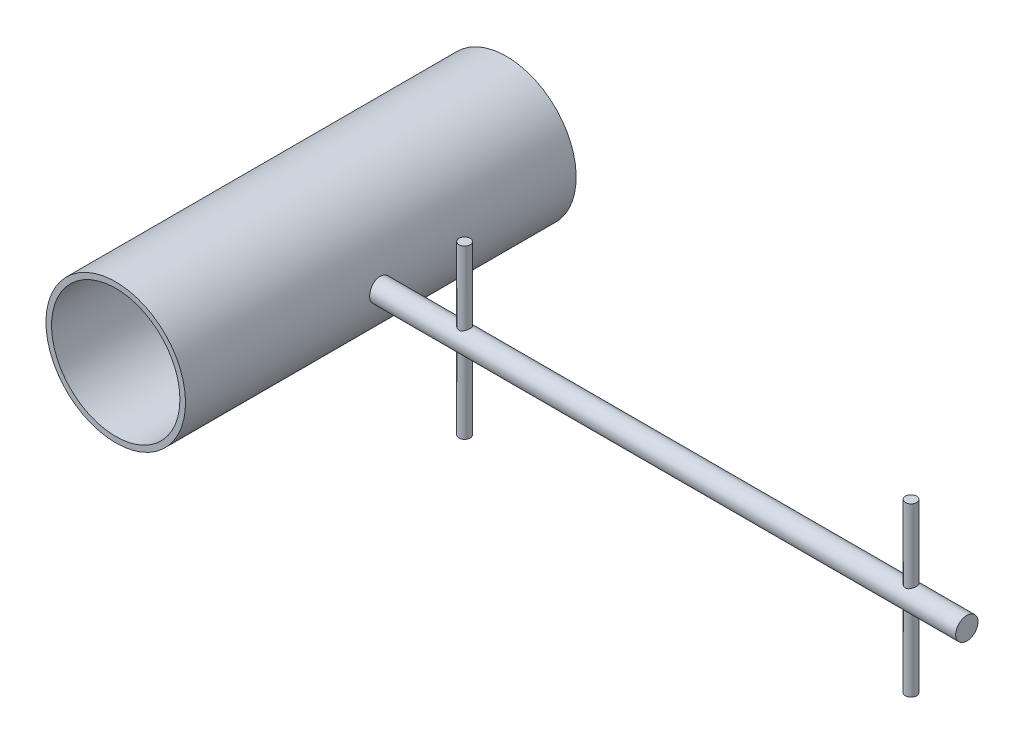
ISO-10303-21;
HEADER;
FILE_DESCRIPTION(('STEP AP214'),'2;1');
FILE_NAME('part.step','',(''),(''),'','','');
FILE_SCHEMA(('AUTOMOTIVE_DESIGN { 1 0 10303 214 1 1 1 1 }'));
ENDSEC;
DATA;
#1=APPLICATION_CONTEXT('core data for automotive mechanical design processes');
#2=APPLICATION_PROTOCOL_DEFINITION('international standard','automotive_design',2000,#1);
#3=PRODUCT_CONTEXT('',#1,'mechanical');
#4=PRODUCT('Part','Part','',(#3));
#5=PRODUCT_RELATED_PRODUCT_CATEGORY('part','',(#4));
#6=PRODUCT_DEFINITION_FORMATION('','',#4);
#7=PRODUCT_DEFINITION_CONTEXT('part definition',#1,'design');
#8=PRODUCT_DEFINITION('design','',#6,#7);
#9=PRODUCT_DEFINITION_SHAPE('','',#8);
#10=(LENGTH_UNIT() NAMED_UNIT(*) SI_UNIT(.MILLI.,.METRE.));
#11=(NAMED_UNIT(*) PLANE_ANGLE_UNIT() SI_UNIT($,.RADIAN.));
#12=(NAMED_UNIT(*) SI_UNIT($,.STERADIAN.) SOLID_ANGLE_UNIT());
#13=UNCERTAINTY_MEASURE_WITH_UNIT(LENGTH_MEASURE(1.E-05),#10,'distance_accuracy_value','');
#14=(GEOMETRIC_REPRESENTATION_CONTEXT(3) GLOBAL_UNCERTAINTY_ASSIGNED_CONTEXT((#13)) GLOBAL_UNIT_ASSIGNED_CONTEXT((#10,
#11,#12)) REPRESENTATION_CONTEXT('',''));
#15=CARTESIAN_POINT('',(0.,0.,0.));
#16=DIRECTION('',(0.,0.,1.));
#17=DIRECTION('',(1.,0.,0.));
#18=AXIS2_PLACEMENT_3D('',#15,#16,#17);
#19=CARTESIAN_POINT('',(0.,0.,-35.));
#20=DIRECTION('',(0.,0.,1.));
#21=DIRECTION('',(1.,0.,0.));
#22=AXIS2_PLACEMENT_3D('',#19,#20,#21);
#23=CYLINDRICAL_SURFACE('',#22,11.5);
#24=CARTESIAN_POINT('',(0.,0.,35.));
#25=DIRECTION('',(0.,0.,1.));
#26=DIRECTION('',(1.,0.,0.));
#27=AXIS2_PLACEMENT_3D('',#24,#25,#26);
#28=CIRCLE('',#27,11.5);
#29=CARTESIAN_POINT('',(11.5,0.,35.));
#30=VERTEX_POINT('',#29);
#31=EDGE_CURVE('E178',#30,#30,#28,.F.);
#32=ORIENTED_EDGE('',*,*,#31,.F.);
#33=EDGE_LOOP('',(#32));
#34=FACE_BOUND('',#33,.T.);
#35=CARTESIAN_POINT('',(0.,0.,-35.));
#36=DIRECTION('',(0.,0.,1.));
#37=DIRECTION('',(1.,0.,0.));
#38=AXIS2_PLACEMENT_3D('',#35,#36,#37);
#39=CIRCLE('',#38,11.5);
#40=CARTESIAN_POINT('',(11.5,0.,-35.));
#41=VERTEX_POINT('',#40);
#42=EDGE_CURVE('E19',#41,#41,#39,.T.);
#43=ORIENTED_EDGE('',*,*,#42,.F.);
#44=EDGE_LOOP('',(#43));
#45=FACE_BOUND('',#44,.T.);
#46=ADVANCED_FACE('F14',(#34,#45),#23,.F.);
#47=CARTESIAN_POINT('',(106.4,-15.,1.1));
#48=DIRECTION('',(0.,-1.,0.));
#49=DIRECTION('',(0.,0.,-1.));
#50=AXIS2_PLACEMENT_3D('',#47,#48,#49);
#51=PLANE('',#50);
#52=CARTESIAN_POINT('',(107.5,-15.,0.));
#53=DIRECTION('',(0.,-1.,0.));
#54=DIRECTION('',(0.,0.,-1.));
#55=AXIS2_PLACEMENT_3D('',#52,#53,#54);
#56=CIRCLE('',#55,0.999999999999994);
#57=CARTESIAN_POINT('',(107.5,-15.,-0.99999999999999));
#58=VERTEX_POINT('',#57);
#59=EDGE_CURVE('E181',#58,#58,#56,.F.);
#60=ORIENTED_EDGE('',*,*,#59,.F.);
#61=EDGE_LOOP('',(#60));
#62=FACE_BOUND('',#61,.T.);
#63=ADVANCED_FACE('F157',(#62),#51,.T.);
#64=CARTESIAN_POINT('',(26.4,-15.,1.1));
#65=DIRECTION('',(0.,-1.,0.));
#66=DIRECTION('',(0.,0.,-1.));
#67=AXIS2_PLACEMENT_3D('',#64,#65,#66);
#68=PLANE('',#67);
#69=CARTESIAN_POINT('',(27.5,-15.,0.));
#70=DIRECTION('',(0.,-1.,0.));
#71=DIRECTION('',(0.,0.,-1.));
#72=AXIS2_PLACEMENT_3D('',#69,#70,#71);
#73=CIRCLE('',#72,0.999999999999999);
#74=CARTESIAN_POINT('',(27.5,-15.,-0.999999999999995));
#75=VERTEX_POINT('',#74);
#76=EDGE_CURVE('E183',#75,#75,#73,.F.);
#77=ORIENTED_EDGE('',*,*,#76,.F.);
#78=EDGE_LOOP('',(#77));
#79=FACE_BOUND('',#78,.T.);
#80=ADVANCED_FACE('F149',(#79),#68,.T.);
#81=CARTESIAN_POINT('',(26.4,15.,-1.1));
#82=DIRECTION('',(0.,1.,0.));
#83=DIRECTION('',(0.,0.,1.));
#84=AXIS2_PLACEMENT_3D('',#81,#82,#83);
#85=PLANE('',#84);
#86=CARTESIAN_POINT('',(27.5,15.,0.));
#87=DIRECTION('',(0.,-1.,0.));
#88=DIRECTION('',(0.,0.,-1.));
#89=AXIS2_PLACEMENT_3D('',#86,#87,#88);
#90=CIRCLE('',#89,1.);
#91=CARTESIAN_POINT('',(27.5,15.,-0.999999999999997));
#92=VERTEX_POINT('',#91);
#93=EDGE_CURVE('E188',#92,#92,#90,.T.);
#94=ORIENTED_EDGE('',*,*,#93,.F.);
#95=EDGE_LOOP('',(#94));
#96=FACE_BOUND('',#95,.T.);
#97=ADVANCED_FACE('F141',(#96),#85,.T.);
#98=CARTESIAN_POINT('',(13.75,-13.75,-35.));
#99=DIRECTION('',(0.,0.,-1.));
#100=DIRECTION('',(-1.,0.,0.));
#101=AXIS2_PLACEMENT_3D('',#98,#99,#100);
#102=PLANE('',#101);
#103=ORIENTED_EDGE('',*,*,#42,.T.);
#104=EDGE_LOOP('',(#103));
#105=FACE_BOUND('',#104,.T.);
#106=CARTESIAN_POINT('',(0.,0.,-35.));
#107=DIRECTION('',(0.,0.,1.));
#108=DIRECTION('',(0.,-1.,0.));
#109=AXIS2_PLACEMENT_3D('',#106,#107,#108);
#110=CIRCLE('',#109,12.5);
#111=CARTESIAN_POINT('',(0.,-12.5,-35.));
#112=VERTEX_POINT('',#111);
#113=EDGE_CURVE('E191',#112,#112,#110,.T.);
#114=ORIENTED_EDGE('',*,*,#113,.F.);
#115=EDGE_LOOP('',(#114));
#116=FACE_BOUND('',#115,.T.);
#117=ADVANCED_FACE('F133',(#105,#116),#102,.T.);
#118=CARTESIAN_POINT('',(-13.75,-13.75,35.));
#119=DIRECTION('',(0.,0.,1.));
#120=DIRECTION('',(1.,0.,0.));
#121=AXIS2_PLACEMENT_3D('',#118,#119,#120);
#122=PLANE('',#121);
#123=ORIENTED_EDGE('',*,*,#31,.T.);
#124=EDGE_LOOP('',(#123));
#125=FACE_BOUND('',#124,.T.);
#126=CARTESIAN_POINT('',(0.,0.,35.));
#127=DIRECTION('',(0.,0.,1.));
#128=DIRECTION('',(0.,-1.,0.));
#129=AXIS2_PLACEMENT_3D('',#126,#127,#128);
#130=CIRCLE('',#129,12.5);
#131=CARTESIAN_POINT('',(0.,-12.5,35.));
#132=VERTEX_POINT('',#131);
#133=EDGE_CURVE('E194',#132,#132,#130,.F.);
#134=ORIENTED_EDGE('',*,*,#133,.F.);
#135=EDGE_LOOP('',(#134));
#136=FACE_BOUND('',#135,.T.);
#137=ADVANCED_FACE('F125',(#125,#136),#122,.T.);
#138=CARTESIAN_POINT('',(117.5,-2.2,2.2));
#139=DIRECTION('',(1.,0.,0.));
#140=DIRECTION('',(0.,0.,-1.));
#141=AXIS2_PLACEMENT_3D('',#138,#139,#140);
#142=PLANE('',#141);
#143=CARTESIAN_POINT('',(117.5,0.,0.));
#144=DIRECTION('',(-1.,0.,0.));
#145=DIRECTION('',(0.,0.,1.));
#146=AXIS2_PLACEMENT_3D('',#143,#144,#145);
#147=CIRCLE('',#146,2.);
#148=CARTESIAN_POINT('',(117.5,0.,2.00000000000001));
#149=VERTEX_POINT('',#148);
#150=EDGE_CURVE('E195',#149,#149,#147,.T.);
#151=ORIENTED_EDGE('',*,*,#150,.F.);
#152=EDGE_LOOP('',(#151));
#153=FACE_BOUND('',#152,.T.);
#154=ADVANCED_FACE('F118',(#153),#142,.T.);
#155=CARTESIAN_POINT('',(107.5,-15.,0.));
#156=DIRECTION('',(0.,-1.,0.));
#157=DIRECTION('',(0.,0.,-1.));
#158=AXIS2_PLACEMENT_3D('',#155,#156,#157);
#159=CYLINDRICAL_SURFACE('',#158,0.999999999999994);
#160=CARTESIAN_POINT('',(107.5,-1.73205080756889,0.999999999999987));
#161=CARTESIAN_POINT('',(107.552107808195,-1.7320553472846,0.999996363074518));
#162=CARTESIAN_POINT('',(107.604281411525,-1.73443801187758,0.995899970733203));
#163=CARTESIAN_POINT('',(107.707027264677,-1.74362366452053,0.979723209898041));
#164=CARTESIAN_POINT('',(107.757595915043,-1.7504359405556,0.967626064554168));
#165=CARTESIAN_POINT('',(107.855451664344,-1.76749346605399,0.936099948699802));
#166=CARTESIAN_POINT('',(107.902754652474,-1.77772043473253,0.91670995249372));
#167=CARTESIAN_POINT('',(107.993424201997,-1.80042664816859,0.871267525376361));
#168=CARTESIAN_POINT('',(108.036790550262,-1.81290601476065,0.845214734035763));
#169=CARTESIAN_POINT('',(108.122305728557,-1.83996869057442,0.78466654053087));
#170=CARTESIAN_POINT('',(108.164059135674,-1.85464063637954,0.749652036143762));
#171=CARTESIAN_POINT('',(108.241408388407,-1.88371982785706,0.673253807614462));
#172=CARTESIAN_POINT('',(108.277001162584,-1.8981269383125,0.631866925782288));
#173=CARTESIAN_POINT('',(108.343367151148,-1.92621476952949,0.540489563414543));
#174=CARTESIAN_POINT('',(108.37365376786,-1.93978106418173,0.490107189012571));
#175=CARTESIAN_POINT('',(108.425140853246,-1.96350756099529,0.3841570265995));
#176=CARTESIAN_POINT('',(108.446347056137,-1.97366991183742,0.32859253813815));
#177=CARTESIAN_POINT('',(108.477504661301,-1.98880461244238,0.218044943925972));
#178=CARTESIAN_POINT('',(108.488149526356,-1.99409480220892,0.163301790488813));
#179=CARTESIAN_POINT('',(108.500166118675,-2.00007583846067,0.052570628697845));
#180=CARTESIAN_POINT('',(108.501543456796,-2.0007694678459,-0.00341660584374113));
#181=CARTESIAN_POINT('',(108.49525332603,-1.9976298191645,-0.109832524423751));
#182=CARTESIAN_POINT('',(108.488361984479,-1.9941849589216,-0.160321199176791));
#183=CARTESIAN_POINT('',(108.467119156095,-1.98374245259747,-0.259313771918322));
#184=CARTESIAN_POINT('',(108.452767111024,-1.97674454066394,-0.307817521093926));
#185=CARTESIAN_POINT('',(108.41691743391,-1.95971583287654,-0.402309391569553));
#186=CARTESIAN_POINT('',(108.395323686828,-1.94964441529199,-0.448253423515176));
#187=CARTESIAN_POINT('',(108.345736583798,-1.92737645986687,-0.535976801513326));
#188=CARTESIAN_POINT('',(108.317740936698,-1.91517916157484,-0.577754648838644));
#189=CARTESIAN_POINT('',(108.253104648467,-1.88844394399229,-0.660173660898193));
#190=CARTESIAN_POINT('',(108.215896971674,-1.87379375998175,-0.700334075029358));
#191=CARTESIAN_POINT('',(108.13541027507,-1.84454340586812,-0.774104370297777));
#192=CARTESIAN_POINT('',(108.092126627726,-1.82994328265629,-0.807709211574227));
#193=CARTESIAN_POINT('',(107.997351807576,-1.80144156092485,-0.869505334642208));
#194=CARTESIAN_POINT('',(107.945513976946,-1.78764319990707,-0.89721731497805));
#195=CARTESIAN_POINT('',(107.837062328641,-1.76375450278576,-0.943319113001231));
#196=CARTESIAN_POINT('',(107.780453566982,-1.75366030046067,-0.96171865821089));
#197=CARTESIAN_POINT('',(107.668785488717,-1.73944635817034,-0.987180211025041));
#198=CARTESIAN_POINT('',(107.613958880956,-1.73491655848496,-0.995025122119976));
#199=CARTESIAN_POINT('',(107.503598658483,-1.73117919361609,-1.00151694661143));
#200=CARTESIAN_POINT('',(107.44806557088,-1.73196786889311,-1.00017035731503));
#201=CARTESIAN_POINT('',(107.344346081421,-1.73834336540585,-0.989036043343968));
#202=CARTESIAN_POINT('',(107.296020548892,-1.74339587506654,-0.980187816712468));
#203=CARTESIAN_POINT('',(107.201632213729,-1.75694021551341,-0.955696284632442));
#204=CARTESIAN_POINT('',(107.155570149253,-1.76543316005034,-0.940050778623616));
#205=CARTESIAN_POINT('',(107.064588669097,-1.78536222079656,-0.901647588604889));
#206=CARTESIAN_POINT('',(107.019820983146,-1.79691643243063,-0.878594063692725));
#207=CARTESIAN_POINT('',(106.934530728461,-1.82156119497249,-0.826287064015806));
#208=CARTESIAN_POINT('',(106.894010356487,-1.83465253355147,-0.797030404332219));
#209=CARTESIAN_POINT('',(106.813021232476,-1.86287998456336,-0.728837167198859));
#210=CARTESIAN_POINT('',(106.773202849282,-1.87806583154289,-0.689145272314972));
#211=CARTESIAN_POINT('',(106.700587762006,-1.90734234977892,-0.603404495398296));
#212=CARTESIAN_POINT('',(106.667793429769,-1.92143265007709,-0.557353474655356));
#213=CARTESIAN_POINT('',(106.60942627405,-1.94741361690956,-0.458535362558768));
#214=CARTESIAN_POINT('',(106.584066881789,-1.95923641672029,-0.405623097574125));
#215=CARTESIAN_POINT('',(106.542862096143,-1.97883354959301,-0.295522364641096));
#216=CARTESIAN_POINT('',(106.527008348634,-1.98661143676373,-0.238337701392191));
#217=CARTESIAN_POINT('',(106.506631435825,-1.99667508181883,-0.126979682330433));
#218=CARTESIAN_POINT('',(106.501202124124,-1.99939927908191,-0.0730114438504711));
#219=CARTESIAN_POINT('',(106.499156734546,-2.00042130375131,0.0351259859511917));
#220=CARTESIAN_POINT('',(106.502537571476,-1.9987206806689,0.0892951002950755));
#221=CARTESIAN_POINT('',(106.517416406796,-1.99133968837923,0.192537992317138));
#222=CARTESIAN_POINT('',(106.528364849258,-1.9859289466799,0.241712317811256));
#223=CARTESIAN_POINT('',(106.557326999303,-1.97192093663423,0.337445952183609));
#224=CARTESIAN_POINT('',(106.575341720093,-1.96332321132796,0.384004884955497));
#225=CARTESIAN_POINT('',(106.618727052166,-1.94325930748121,0.475423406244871));
#226=CARTESIAN_POINT('',(106.644379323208,-1.93168617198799,0.520125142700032));
#227=CARTESIAN_POINT('',(106.701957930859,-1.90688133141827,0.604774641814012));
#228=CARTESIAN_POINT('',(106.733887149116,-1.89364886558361,0.644720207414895));
#229=CARTESIAN_POINT('',(106.806797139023,-1.86528610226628,0.722914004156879));
#230=CARTESIAN_POINT('',(106.848362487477,-1.85009799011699,0.760597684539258));
#231=CARTESIAN_POINT('',(106.93745072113,-1.82063076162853,0.82866328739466));
#232=CARTESIAN_POINT('',(106.984978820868,-1.80635245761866,0.859038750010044));
#233=CARTESIAN_POINT('',(107.086636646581,-1.77999605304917,0.912431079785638));
#234=CARTESIAN_POINT('',(107.140927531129,-1.76800174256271,0.935185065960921));
#235=CARTESIAN_POINT('',(107.25333240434,-1.74866156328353,0.970878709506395));
#236=CARTESIAN_POINT('',(107.311432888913,-1.74130016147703,0.983851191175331));
#237=CARTESIAN_POINT('',(107.391805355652,-1.73529272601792,0.9943670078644));
#238=CARTESIAN_POINT('',(107.413367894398,-1.73408129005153,0.996476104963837));
#239=CARTESIAN_POINT('',(107.456616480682,-1.73245935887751,0.999293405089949));
#240=CARTESIAN_POINT('',(107.478302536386,-1.7320489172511,1.00000151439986));
#241=CARTESIAN_POINT('',(107.5,-1.73205080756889,0.999999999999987));
#242=B_SPLINE_CURVE_WITH_KNOTS('',3,(#160,#161,#162,#163,#164,#165,#166,#167,#168,#169,#170,
#171,#172,#173,#174,#175,#176,#177,#178,#179,#180,#181,#182,#183,#184,#185,#186,#187,#188,#189,
#190,#191,#192,#193,#194,#195,#196,#197,#198,#199,#200,#201,#202,#203,#204,#205,#206,#207,#208,
#209,#210,#211,#212,#213,#214,#215,#216,#217,#218,#219,#220,#221,#222,#223,#224,#225,#226,#227,
#228,#229,#230,#231,#232,#233,#234,#235,#236,#237,#238,#239,#240,#241),.UNSPECIFIED.,.T.,.F.,(4,
2,2,2,2,2,2,2,2,2,2,2,2,2,2,2,2,2,2,2,2,2,2,2,2,2,2,2,2,2,2,2,2,2,2,2,2,2,2,2,4),(0.,
0.15623212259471,0.312792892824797,0.468528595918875,0.62427272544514,0.792862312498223,
0.961535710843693,1.14157892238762,1.3215082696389,1.48863484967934,1.65566023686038,
1.80816097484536,1.96067312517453,2.11529534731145,2.2699729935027,2.43927191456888,
2.60870048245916,2.78888841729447,2.96888774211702,3.13462290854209,3.30024093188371,
3.44774183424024,3.5952905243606,3.74967296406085,3.90413486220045,4.0780674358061,
4.25205864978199,4.43064181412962,4.60906779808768,4.77112270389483,4.93312086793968,
5.0844442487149,5.23578933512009,5.39360750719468,5.55149830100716,5.72510241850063,
5.89885942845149,6.07810749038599,6.25675133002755,6.32180135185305,6.38685572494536),.UNSPECIFIED.);
#243=CARTESIAN_POINT('',(107.5,-1.73205080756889,0.999999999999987));
#244=VERTEX_POINT('',#243);
#245=EDGE_CURVE('E43',#244,#244,#242,.T.);
#246=ORIENTED_EDGE('',*,*,#245,.F.);
#247=EDGE_LOOP('',(#246));
#248=FACE_BOUND('',#247,.T.);
#249=ORIENTED_EDGE('',*,*,#59,.T.);
#250=EDGE_LOOP('',(#249));
#251=FACE_BOUND('',#250,.T.);
#252=ADVANCED_FACE('F111',(#248,#251),#159,.T.);
#253=CARTESIAN_POINT('',(27.5,-15.,0.));
#254=DIRECTION('',(0.,-1.,0.));
#255=DIRECTION('',(0.,0.,-1.));
#256=AXIS2_PLACEMENT_3D('',#253,#254,#255);
#257=CYLINDRICAL_SURFACE('',#256,0.999999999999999);
#258=CARTESIAN_POINT('',(27.5,-1.73205080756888,0.999999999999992));
#259=CARTESIAN_POINT('',(27.5521078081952,-1.7320553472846,0.999996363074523));
#260=CARTESIAN_POINT('',(27.604281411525,-1.73443801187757,0.995899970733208));
#261=CARTESIAN_POINT('',(27.7070272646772,-1.74362366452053,0.979723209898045));
#262=CARTESIAN_POINT('',(27.7575959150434,-1.7504359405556,0.967626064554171));
#263=CARTESIAN_POINT('',(27.8554516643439,-1.76749346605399,0.936099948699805));
#264=CARTESIAN_POINT('',(27.9027546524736,-1.77772043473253,0.916709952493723));
#265=CARTESIAN_POINT('',(27.9934242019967,-1.80042664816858,0.871267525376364));
#266=CARTESIAN_POINT('',(28.0367905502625,-1.81290601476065,0.845214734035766));
#267=CARTESIAN_POINT('',(28.1223057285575,-1.83996869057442,0.784666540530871));
#268=CARTESIAN_POINT('',(28.1640591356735,-1.85464063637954,0.749652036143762));
#269=CARTESIAN_POINT('',(28.2414083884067,-1.88371982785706,0.673253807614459));
#270=CARTESIAN_POINT('',(28.2770011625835,-1.8981269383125,0.631866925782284));
#271=CARTESIAN_POINT('',(28.3433671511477,-1.92621476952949,0.540489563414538));
#272=CARTESIAN_POINT('',(28.3736537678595,-1.93978106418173,0.490107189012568));
#273=CARTESIAN_POINT('',(28.4251408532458,-1.96350756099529,0.384157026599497));
#274=CARTESIAN_POINT('',(28.4463470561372,-1.97366991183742,0.328592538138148));
#275=CARTESIAN_POINT('',(28.4775046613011,-1.98880461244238,0.21804494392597));
#276=CARTESIAN_POINT('',(28.4881495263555,-1.99409480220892,0.163301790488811));
#277=CARTESIAN_POINT('',(28.500166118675,-2.00007583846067,0.052570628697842));
#278=CARTESIAN_POINT('',(28.5015434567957,-2.0007694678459,-0.00341660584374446));
#279=CARTESIAN_POINT('',(28.4952533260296,-1.9976298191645,-0.109832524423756));
#280=CARTESIAN_POINT('',(28.4883619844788,-1.9941849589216,-0.160321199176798));
#281=CARTESIAN_POINT('',(28.4671191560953,-1.98374245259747,-0.259313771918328));
#282=CARTESIAN_POINT('',(28.4527671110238,-1.97674454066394,-0.307817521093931));
#283=CARTESIAN_POINT('',(28.4169174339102,-1.95971583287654,-0.402309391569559));
#284=CARTESIAN_POINT('',(28.3953236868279,-1.94964441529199,-0.448253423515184));
#285=CARTESIAN_POINT('',(28.3457365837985,-1.92737645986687,-0.535976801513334));
#286=CARTESIAN_POINT('',(28.3177409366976,-1.91517916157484,-0.577754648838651));
#287=CARTESIAN_POINT('',(28.253104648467,-1.88844394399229,-0.6601736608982));
#288=CARTESIAN_POINT('',(28.215896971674,-1.87379375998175,-0.700334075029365));
#289=CARTESIAN_POINT('',(28.1354102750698,-1.84454340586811,-0.774104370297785));
#290=CARTESIAN_POINT('',(28.0921266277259,-1.82994328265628,-0.807709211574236));
#291=CARTESIAN_POINT('',(27.9973518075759,-1.80144156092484,-0.869505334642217));
#292=CARTESIAN_POINT('',(27.9455139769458,-1.78764319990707,-0.897217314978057));
#293=CARTESIAN_POINT('',(27.837062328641,-1.76375450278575,-0.943319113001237));
#294=CARTESIAN_POINT('',(27.7804535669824,-1.75366030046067,-0.961718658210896));
#295=CARTESIAN_POINT('',(27.6687854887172,-1.73944635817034,-0.987180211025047));
#296=CARTESIAN_POINT('',(27.6139588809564,-1.73491655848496,-0.995025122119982));
#297=CARTESIAN_POINT('',(27.5035986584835,-1.73117919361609,-1.00151694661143));
#298=CARTESIAN_POINT('',(27.4480655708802,-1.73196786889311,-1.00017035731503));
#299=CARTESIAN_POINT('',(27.3443460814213,-1.73834336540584,-0.989036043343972));
#300=CARTESIAN_POINT('',(27.2960205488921,-1.74339587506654,-0.980187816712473));
#301=CARTESIAN_POINT('',(27.201632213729,-1.75694021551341,-0.955696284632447));
#302=CARTESIAN_POINT('',(27.1555701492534,-1.76543316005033,-0.940050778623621));
#303=CARTESIAN_POINT('',(27.0645886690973,-1.78536222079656,-0.901647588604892));
#304=CARTESIAN_POINT('',(27.0198209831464,-1.79691643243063,-0.878594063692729));
#305=CARTESIAN_POINT('',(26.934530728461,-1.82156119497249,-0.82628706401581));
#306=CARTESIAN_POINT('',(26.8940103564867,-1.83465253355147,-0.797030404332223));
#307=CARTESIAN_POINT('',(26.8130212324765,-1.86287998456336,-0.72883716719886));
#308=CARTESIAN_POINT('',(26.7732028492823,-1.87806583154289,-0.689145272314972));
#309=CARTESIAN_POINT('',(26.7005877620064,-1.90734234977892,-0.603404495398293));
#310=CARTESIAN_POINT('',(26.6677934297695,-1.92143265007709,-0.557353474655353));
#311=CARTESIAN_POINT('',(26.6094262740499,-1.94741361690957,-0.458535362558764));
#312=CARTESIAN_POINT('',(26.5840668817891,-1.95923641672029,-0.405623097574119));
#313=CARTESIAN_POINT('',(26.5428620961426,-1.97883354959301,-0.295522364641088));
#314=CARTESIAN_POINT('',(26.5270083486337,-1.98661143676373,-0.238337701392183));
#315=CARTESIAN_POINT('',(26.5066314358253,-1.99667508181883,-0.126979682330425));
#316=CARTESIAN_POINT('',(26.5012021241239,-1.99939927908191,-0.0730114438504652));
#317=CARTESIAN_POINT('',(26.4991567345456,-2.00042130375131,0.0351259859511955));
#318=CARTESIAN_POINT('',(26.5025375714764,-1.9987206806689,0.0892951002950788));
#319=CARTESIAN_POINT('',(26.5174164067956,-1.99133968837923,0.192537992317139));
#320=CARTESIAN_POINT('',(26.5283648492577,-1.9859289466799,0.241712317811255));
#321=CARTESIAN_POINT('',(26.557326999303,-1.97192093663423,0.337445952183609));
#322=CARTESIAN_POINT('',(26.5753417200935,-1.96332321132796,0.3840048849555));
#323=CARTESIAN_POINT('',(26.618727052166,-1.9432593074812,0.475423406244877));
#324=CARTESIAN_POINT('',(26.6443793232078,-1.93168617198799,0.520125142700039));
#325=CARTESIAN_POINT('',(26.701957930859,-1.90688133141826,0.604774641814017));
#326=CARTESIAN_POINT('',(26.7338871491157,-1.89364886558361,0.644720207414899));
#327=CARTESIAN_POINT('',(26.8067971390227,-1.86528610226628,0.722914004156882));
#328=CARTESIAN_POINT('',(26.8483624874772,-1.85009799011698,0.760597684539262));
#329=CARTESIAN_POINT('',(26.9374507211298,-1.82063076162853,0.828663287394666));
#330=CARTESIAN_POINT('',(26.9849788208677,-1.80635245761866,0.859038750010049));
#331=CARTESIAN_POINT('',(27.086636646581,-1.77999605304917,0.912431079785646));
#332=CARTESIAN_POINT('',(27.1409275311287,-1.76800174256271,0.935185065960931));
#333=CARTESIAN_POINT('',(27.2533324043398,-1.74866156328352,0.970878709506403));
#334=CARTESIAN_POINT('',(27.3114328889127,-1.74130016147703,0.983851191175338));
#335=CARTESIAN_POINT('',(27.391805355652,-1.73529272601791,0.994367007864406));
#336=CARTESIAN_POINT('',(27.4133678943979,-1.73408129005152,0.996476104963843));
#337=CARTESIAN_POINT('',(27.4566164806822,-1.73245935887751,0.999293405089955));
#338=CARTESIAN_POINT('',(27.4783025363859,-1.7320489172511,1.00000151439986));
#339=CARTESIAN_POINT('',(27.5,-1.73205080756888,0.999999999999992));
#340=B_SPLINE_CURVE_WITH_KNOTS('',3,(#258,#259,#260,#261,#262,#263,#264,#265,#266,#267,#268,
#269,#270,#271,#272,#273,#274,#275,#276,#277,#278,#279,#280,#281,#282,#283,#284,#285,#286,#287,
#288,#289,#290,#291,#292,#293,#294,#295,#296,#297,#298,#299,#300,#301,#302,#303,#304,#305,#306,
#307,#308,#309,#310,#311,#312,#313,#314,#315,#316,#317,#318,#319,#320,#321,#322,#323,#324,#325,
#326,#327,#328,#329,#330,#331,#332,#333,#334,#335,#336,#337,#338,#339),.UNSPECIFIED.,.T.,.F.,(4,
2,2,2,2,2,2,2,2,2,2,2,2,2,2,2,2,2,2,2,2,2,2,2,2,2,2,2,2,2,2,2,2,2,2,2,2,2,2,2,4),(0.,
0.156232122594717,0.312792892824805,0.468528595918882,0.624272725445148,0.792862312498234,
0.961535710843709,1.14157892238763,1.32150826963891,1.48863484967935,1.6556602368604,
1.80816097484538,1.96067312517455,2.11529534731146,2.26997299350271,2.4392719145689,
2.60870048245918,2.78888841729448,2.96888774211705,3.13462290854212,3.30024093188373,
3.44774183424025,3.59529052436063,3.74967296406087,3.90413486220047,4.07806743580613,
4.25205864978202,4.43064181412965,4.60906779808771,4.77112270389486,4.93312086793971,
5.08444424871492,5.23578933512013,5.39360750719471,5.55149830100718,5.72510241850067,
5.89885942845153,6.07810749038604,6.25675133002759,6.32180135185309,6.3868557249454),.UNSPECIFIED.);
#341=CARTESIAN_POINT('',(27.5,-1.73205080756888,0.999999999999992));
#342=VERTEX_POINT('',#341);
#343=EDGE_CURVE('E59',#342,#342,#340,.T.);
#344=ORIENTED_EDGE('',*,*,#343,.F.);
#345=EDGE_LOOP('',(#344));
#346=FACE_BOUND('',#345,.T.);
#347=ORIENTED_EDGE('',*,*,#76,.T.);
#348=EDGE_LOOP('',(#347));
#349=FACE_BOUND('',#348,.T.);
#350=ADVANCED_FACE('F67',(#346,#349),#257,.T.);
#351=CARTESIAN_POINT('',(27.5,1.65244039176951,0.));
#352=DIRECTION('',(0.,-1.,0.));
#353=DIRECTION('',(0.,0.,-1.));
#354=AXIS2_PLACEMENT_3D('',#351,#352,#353);
#355=CYLINDRICAL_SURFACE('',#354,1.);
#356=CARTESIAN_POINT('',(27.5,1.73205080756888,1.00000000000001));
#357=CARTESIAN_POINT('',(27.4478921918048,1.73205534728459,0.999996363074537));
#358=CARTESIAN_POINT('',(27.395718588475,1.73443801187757,0.995899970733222));
#359=CARTESIAN_POINT('',(27.2929727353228,1.74362366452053,0.979723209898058));
#360=CARTESIAN_POINT('',(27.2424040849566,1.7504359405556,0.967626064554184));
#361=CARTESIAN_POINT('',(27.1445483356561,1.76749346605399,0.936099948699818));
#362=CARTESIAN_POINT('',(27.0972453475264,1.77772043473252,0.916709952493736));
#363=CARTESIAN_POINT('',(27.0065757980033,1.80042664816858,0.871267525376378));
#364=CARTESIAN_POINT('',(26.9632094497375,1.81290601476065,0.845214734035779));
#365=CARTESIAN_POINT('',(26.8776942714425,1.83996869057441,0.784666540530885));
#366=CARTESIAN_POINT('',(26.8359408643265,1.85464063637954,0.749652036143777));
#367=CARTESIAN_POINT('',(26.7585916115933,1.88371982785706,0.673253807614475));
#368=CARTESIAN_POINT('',(26.7229988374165,1.8981269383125,0.6318669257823));
#369=CARTESIAN_POINT('',(26.6566328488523,1.92621476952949,0.540489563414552));
#370=CARTESIAN_POINT('',(26.6263462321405,1.93978106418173,0.490107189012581));
#371=CARTESIAN_POINT('',(26.5748591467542,1.96350756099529,0.384157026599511));
#372=CARTESIAN_POINT('',(26.5536529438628,1.97366991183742,0.328592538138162));
#373=CARTESIAN_POINT('',(26.5224953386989,1.98880461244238,0.218044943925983));
#374=CARTESIAN_POINT('',(26.5118504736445,1.99409480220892,0.163301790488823));
#375=CARTESIAN_POINT('',(26.499833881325,2.00007583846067,0.052570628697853));
#376=CARTESIAN_POINT('',(26.4984565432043,2.0007694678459,-0.00341660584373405));
#377=CARTESIAN_POINT('',(26.5047466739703,1.9976298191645,-0.109832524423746));
#378=CARTESIAN_POINT('',(26.5116380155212,1.99418495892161,-0.160321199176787));
#379=CARTESIAN_POINT('',(26.5328808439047,1.98374245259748,-0.259313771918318));
#380=CARTESIAN_POINT('',(26.5472328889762,1.97674454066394,-0.307817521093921));
#381=CARTESIAN_POINT('',(26.5830825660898,1.95971583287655,-0.402309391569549));
#382=CARTESIAN_POINT('',(26.6046763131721,1.94964441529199,-0.448253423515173));
#383=CARTESIAN_POINT('',(26.6542634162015,1.92737645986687,-0.535976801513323));
#384=CARTESIAN_POINT('',(26.6822590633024,1.91517916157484,-0.577754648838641));
#385=CARTESIAN_POINT('',(26.746895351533,1.88844394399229,-0.66017366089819));
#386=CARTESIAN_POINT('',(26.784103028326,1.87379375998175,-0.700334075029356));
#387=CARTESIAN_POINT('',(26.8645897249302,1.84454340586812,-0.774104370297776));
#388=CARTESIAN_POINT('',(26.9078733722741,1.82994328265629,-0.807709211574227));
#389=CARTESIAN_POINT('',(27.0026481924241,1.80144156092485,-0.869505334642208));
#390=CARTESIAN_POINT('',(27.0544860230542,1.78764319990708,-0.897217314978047));
#391=CARTESIAN_POINT('',(27.162937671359,1.76375450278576,-0.943319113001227));
#392=CARTESIAN_POINT('',(27.2195464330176,1.75366030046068,-0.961718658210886));
#393=CARTESIAN_POINT('',(27.3312145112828,1.73944635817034,-0.987180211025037));
#394=CARTESIAN_POINT('',(27.3860411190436,1.73491655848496,-0.995025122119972));
#395=CARTESIAN_POINT('',(27.4964013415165,1.7311791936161,-1.00151694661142));
#396=CARTESIAN_POINT('',(27.5519344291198,1.73196786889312,-1.00017035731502));
#397=CARTESIAN_POINT('',(27.6556539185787,1.73834336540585,-0.989036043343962));
#398=CARTESIAN_POINT('',(27.7039794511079,1.74339587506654,-0.980187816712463));
#399=CARTESIAN_POINT('',(27.798367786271,1.75694021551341,-0.955696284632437));
#400=CARTESIAN_POINT('',(27.8444298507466,1.76543316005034,-0.940050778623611));
#401=CARTESIAN_POINT('',(27.9354113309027,1.78536222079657,-0.901647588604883));
#402=CARTESIAN_POINT('',(27.9801790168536,1.79691643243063,-0.878594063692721));
#403=CARTESIAN_POINT('',(28.065469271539,1.8215611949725,-0.826287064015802));
#404=CARTESIAN_POINT('',(28.1059896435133,1.83465253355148,-0.797030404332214));
#405=CARTESIAN_POINT('',(28.1869787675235,1.86287998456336,-0.72883716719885));
#406=CARTESIAN_POINT('',(28.2267971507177,1.87806583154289,-0.689145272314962));
#407=CARTESIAN_POINT('',(28.2994122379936,1.90734234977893,-0.603404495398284));
#408=CARTESIAN_POINT('',(28.3322065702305,1.92143265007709,-0.557353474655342));
#409=CARTESIAN_POINT('',(28.3905737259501,1.94741361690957,-0.458535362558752));
#410=CARTESIAN_POINT('',(28.4159331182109,1.95923641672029,-0.405623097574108));
#411=CARTESIAN_POINT('',(28.4571379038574,1.97883354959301,-0.295522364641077));
#412=CARTESIAN_POINT('',(28.4729916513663,1.98661143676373,-0.238337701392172));
#413=CARTESIAN_POINT('',(28.4933685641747,1.99667508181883,-0.126979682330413));
#414=CARTESIAN_POINT('',(28.4987978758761,1.99939927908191,-0.0730114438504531));
#415=CARTESIAN_POINT('',(28.5008432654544,2.00042130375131,0.0351259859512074));
#416=CARTESIAN_POINT('',(28.4974624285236,1.9987206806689,0.0892951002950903));
#417=CARTESIAN_POINT('',(28.4825835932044,1.99133968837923,0.192537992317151));
#418=CARTESIAN_POINT('',(28.4716351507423,1.9859289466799,0.241712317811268));
#419=CARTESIAN_POINT('',(28.442673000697,1.97192093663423,0.337445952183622));
#420=CARTESIAN_POINT('',(28.4246582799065,1.96332321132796,0.384004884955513));
#421=CARTESIAN_POINT('',(28.381272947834,1.9432593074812,0.47542340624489));
#422=CARTESIAN_POINT('',(28.3556206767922,1.93168617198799,0.520125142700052));
#423=CARTESIAN_POINT('',(28.298042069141,1.90688133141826,0.604774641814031));
#424=CARTESIAN_POINT('',(28.2661128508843,1.89364886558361,0.644720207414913));
#425=CARTESIAN_POINT('',(28.1932028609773,1.86528610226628,0.722914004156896));
#426=CARTESIAN_POINT('',(28.1516375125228,1.85009799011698,0.760597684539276));
#427=CARTESIAN_POINT('',(28.0625492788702,1.82063076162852,0.828663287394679));
#428=CARTESIAN_POINT('',(28.0150211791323,1.80635245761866,0.859038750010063));
#429=CARTESIAN_POINT('',(27.913363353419,1.77999605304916,0.912431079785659));
#430=CARTESIAN_POINT('',(27.8590724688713,1.7680017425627,0.935185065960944));
#431=CARTESIAN_POINT('',(27.7466675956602,1.74866156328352,0.970878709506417));
#432=CARTESIAN_POINT('',(27.6885671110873,1.74130016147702,0.983851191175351));
#433=CARTESIAN_POINT('',(27.608194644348,1.73529272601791,0.99436700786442));
#434=CARTESIAN_POINT('',(27.5866321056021,1.73408129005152,0.996476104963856));
#435=CARTESIAN_POINT('',(27.5433835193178,1.7324593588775,0.999293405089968));
#436=CARTESIAN_POINT('',(27.5216974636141,1.73204891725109,1.00000151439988));
#437=CARTESIAN_POINT('',(27.5,1.73205080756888,1.00000000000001));
#438=B_SPLINE_CURVE_WITH_KNOTS('',3,(#356,#357,#358,#359,#360,#361,#362,#363,#364,#365,#366,
#367,#368,#369,#370,#371,#372,#373,#374,#375,#376,#377,#378,#379,#380,#381,#382,#383,#384,#385,
#386,#387,#388,#389,#390,#391,#392,#393,#394,#395,#396,#397,#398,#399,#400,#401,#402,#403,#404,
#405,#406,#407,#408,#409,#410,#411,#412,#413,#414,#415,#416,#417,#418,#419,#420,#421,#422,#423,
#424,#425,#426,#427,#428,#429,#430,#431,#432,#433,#434,#435,#436,#437),.UNSPECIFIED.,.T.,.F.,(4,
2,2,2,2,2,2,2,2,2,2,2,2,2,2,2,2,2,2,2,2,2,2,2,2,2,2,2,2,2,2,2,2,2,2,2,2,2,2,2,4),(0.,
0.156232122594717,0.312792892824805,0.468528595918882,0.624272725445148,0.792862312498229,
0.961535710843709,1.14157892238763,1.32150826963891,1.48863484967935,1.6556602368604,
1.80816097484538,1.96067312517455,2.11529534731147,2.26997299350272,2.43927191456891,
2.60870048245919,2.78888841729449,2.96888774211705,3.13462290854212,3.30024093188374,
3.44774183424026,3.59529052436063,3.74967296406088,3.90413486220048,4.07806743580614,
4.25205864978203,4.43064181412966,4.60906779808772,4.77112270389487,4.93312086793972,
5.08444424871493,5.23578933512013,5.39360750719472,5.55149830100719,5.72510241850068,
5.89885942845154,6.07810749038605,6.25675133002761,6.3218013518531,6.38685572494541),.UNSPECIFIED.);
#439=CARTESIAN_POINT('',(27.5,1.73205080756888,1.00000000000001));
#440=VERTEX_POINT('',#439);
#441=EDGE_CURVE('E54',#440,#440,#438,.T.);
#442=ORIENTED_EDGE('',*,*,#441,.F.);
#443=EDGE_LOOP('',(#442));
#444=FACE_BOUND('',#443,.T.);
#445=ORIENTED_EDGE('',*,*,#93,.T.);
#446=EDGE_LOOP('',(#445));
#447=FACE_BOUND('',#446,.T.);
#448=ADVANCED_FACE('F63',(#444,#447),#355,.T.);
#449=CARTESIAN_POINT('',(0.,0.,35.));
#450=DIRECTION('',(0.,0.,1.));
#451=DIRECTION('',(0.,-1.,0.));
#452=AXIS2_PLACEMENT_3D('',#449,#450,#451);
#453=CYLINDRICAL_SURFACE('',#452,12.5);
#454=ORIENTED_EDGE('',*,*,#133,.T.);
#455=EDGE_LOOP('',(#454));
#456=FACE_BOUND('',#455,.T.);
#457=CARTESIAN_POINT('',(12.3389626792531,-2.,0.));
#458=CARTESIAN_POINT('',(12.3389646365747,-1.99999546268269,-0.111566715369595));
#459=CARTESIAN_POINT('',(12.3404922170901,-1.99063305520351,-0.223195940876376));
#460=CARTESIAN_POINT('',(12.3464325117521,-1.95344445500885,-0.443326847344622));
#461=CARTESIAN_POINT('',(12.3508479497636,-1.92560083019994,-0.55182547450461));
#462=CARTESIAN_POINT('',(12.3620513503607,-1.85230972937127,-0.762477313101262));
#463=CARTESIAN_POINT('',(12.3688373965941,-1.8068764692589,-0.864635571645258));
#464=CARTESIAN_POINT('',(12.3840151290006,-1.69973041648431,-1.05986648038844));
#465=CARTESIAN_POINT('',(12.3924066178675,-1.63801962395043,-1.15294024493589));
#466=CARTESIAN_POINT('',(12.409935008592,-1.4994714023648,-1.32821893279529));
#467=CARTESIAN_POINT('',(12.4190774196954,-1.42251498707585,-1.41032926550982));
#468=CARTESIAN_POINT('',(12.4370285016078,-1.25591709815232,-1.56052945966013));
#469=CARTESIAN_POINT('',(12.4458371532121,-1.16627489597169,-1.62861851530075));
#470=CARTESIAN_POINT('',(12.4621862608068,-0.976239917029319,-1.74919596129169));
#471=CARTESIAN_POINT('',(12.4697194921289,-0.875790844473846,-1.8015966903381));
#472=CARTESIAN_POINT('',(12.4826077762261,-0.66737599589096,-1.88874693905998));
#473=CARTESIAN_POINT('',(12.4879629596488,-0.559410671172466,-1.92349751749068));
#474=CARTESIAN_POINT('',(12.4958528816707,-0.340004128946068,-1.97407274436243));
#475=CARTESIAN_POINT('',(12.49841126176,-0.228600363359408,-1.9900561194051));
#476=CARTESIAN_POINT('',(12.500500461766,-0.00466480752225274,-2.0031365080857));
#477=CARTESIAN_POINT('',(12.5000314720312,0.10786691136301,-2.00023470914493));
#478=CARTESIAN_POINT('',(12.4961375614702,0.32977971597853,-1.97575151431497));
#479=CARTESIAN_POINT('',(12.4927396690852,0.439180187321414,-1.95434091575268));
#480=CARTESIAN_POINT('',(12.4833998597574,0.652815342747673,-1.89371648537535));
#481=CARTESIAN_POINT('',(12.4774578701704,0.757049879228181,-1.85450214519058));
#482=CARTESIAN_POINT('',(12.4636513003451,0.957905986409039,-1.75921154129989));
#483=CARTESIAN_POINT('',(12.4557786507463,1.05449329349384,-1.70306427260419));
#484=CARTESIAN_POINT('',(12.4389865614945,1.23693967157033,-1.575553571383));
#485=CARTESIAN_POINT('',(12.4300670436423,1.32279794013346,-1.50418900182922));
#486=CARTESIAN_POINT('',(12.4120565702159,1.48235721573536,-1.34732043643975));
#487=CARTESIAN_POINT('',(12.4029648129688,1.555911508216,-1.2616672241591));
#488=CARTESIAN_POINT('',(12.3857313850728,1.68762680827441,-1.07915724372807));
#489=CARTESIAN_POINT('',(12.3775897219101,1.74578769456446,-0.982300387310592));
#490=CARTESIAN_POINT('',(12.3631781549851,1.84509031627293,-0.779969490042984));
#491=CARTESIAN_POINT('',(12.3569100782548,1.88621545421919,-0.674487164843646));
#492=CARTESIAN_POINT('',(12.3469864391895,1.95012354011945,-0.457989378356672));
#493=CARTESIAN_POINT('',(12.343330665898,1.97290796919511,-0.346974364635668));
#494=CARTESIAN_POINT('',(12.3390860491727,1.99928349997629,-0.12387217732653));
#495=CARTESIAN_POINT('',(12.338463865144,2.00308326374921,-0.0118102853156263));
#496=CARTESIAN_POINT('',(12.3402681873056,1.99193667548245,0.21134896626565));
#497=CARTESIAN_POINT('',(12.3426945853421,1.97699098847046,0.322446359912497));
#498=CARTESIAN_POINT('',(12.3502919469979,1.92895527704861,0.539866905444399));
#499=CARTESIAN_POINT('',(12.3554469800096,1.89597053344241,0.646213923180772));
#500=CARTESIAN_POINT('',(12.3679074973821,1.81290306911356,0.851870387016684));
#501=CARTESIAN_POINT('',(12.3752131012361,1.76281939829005,0.951179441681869));
#502=CARTESIAN_POINT('',(12.3912295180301,1.64647965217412,1.14087239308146));
#503=CARTESIAN_POINT('',(12.3999517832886,1.58008930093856,1.23117295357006));
#504=CARTESIAN_POINT('',(12.4177848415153,1.43320604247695,1.39942606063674));
#505=CARTESIAN_POINT('',(12.426895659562,1.35271222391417,1.47737780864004));
#506=CARTESIAN_POINT('',(12.4445842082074,1.17898475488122,1.61947729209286));
#507=CARTESIAN_POINT('',(12.4531560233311,1.085636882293,1.68348622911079));
#508=CARTESIAN_POINT('',(12.4687070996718,0.88939184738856,1.7949130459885));
#509=CARTESIAN_POINT('',(12.4756864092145,0.786494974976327,1.8423314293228));
#510=CARTESIAN_POINT('',(12.4872402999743,0.574493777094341,1.9190127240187));
#511=CARTESIAN_POINT('',(12.491824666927,0.465416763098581,1.948349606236));
#512=CARTESIAN_POINT('',(12.4981133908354,0.243805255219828,1.98827383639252));
#513=CARTESIAN_POINT('',(12.4998179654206,0.131271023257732,1.99886260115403));
#514=CARTESIAN_POINT('',(12.5001523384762,-0.09271816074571,2.00095179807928));
#515=CARTESIAN_POINT('',(12.4988162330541,-0.204171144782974,1.99266389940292));
#516=CARTESIAN_POINT('',(12.4932886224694,-0.424076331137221,1.95769116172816));
#517=CARTESIAN_POINT('',(12.4890971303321,-0.532528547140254,1.93100640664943));
#518=CARTESIAN_POINT('',(12.4783277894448,-0.743282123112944,1.86007617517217));
#519=CARTESIAN_POINT('',(12.471752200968,-0.845589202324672,1.81584732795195));
#520=CARTESIAN_POINT('',(12.4569342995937,-1.04136319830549,1.71110753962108));
#521=CARTESIAN_POINT('',(12.4486919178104,-1.13482974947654,1.65059592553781));
#522=CARTESIAN_POINT('',(12.4313454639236,-1.31133889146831,1.51425167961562));
#523=CARTESIAN_POINT('',(12.4222331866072,-1.39426053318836,1.43826349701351));
#524=CARTESIAN_POINT('',(12.4042323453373,-1.54625119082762,1.27345013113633));
#525=CARTESIAN_POINT('',(12.3953438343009,-1.61531695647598,1.1846219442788));
#526=CARTESIAN_POINT('',(12.3787350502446,-1.73804191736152,0.995970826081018));
#527=CARTESIAN_POINT('',(12.3710226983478,-1.79159866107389,0.896080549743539));
#528=CARTESIAN_POINT('',(12.35773272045,-1.88109182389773,0.688641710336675));
#529=CARTESIAN_POINT('',(12.3521529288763,-1.91704612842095,0.581101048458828));
#530=CARTESIAN_POINT('',(12.3450187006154,-1.96235985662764,0.394262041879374));
#531=CARTESIAN_POINT('',(12.3427600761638,-1.97645270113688,0.316104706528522));
#532=CARTESIAN_POINT('',(12.339731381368,-1.99527431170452,0.158642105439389));
#533=CARTESIAN_POINT('',(12.3389612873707,-2.00000322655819,0.0793368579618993));
#534=CARTESIAN_POINT('',(12.3389626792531,-2.,0.));
#535=B_SPLINE_CURVE_WITH_KNOTS('',3,(#457,#458,#459,#460,#461,#462,#463,#464,#465,#466,#467,
#468,#469,#470,#471,#472,#473,#474,#475,#476,#477,#478,#479,#480,#481,#482,#483,#484,#485,#486,
#487,#488,#489,#490,#491,#492,#493,#494,#495,#496,#497,#498,#499,#500,#501,#502,#503,#504,#505,
#506,#507,#508,#509,#510,#511,#512,#513,#514,#515,#516,#517,#518,#519,#520,#521,#522,#523,#524,
#525,#526,#527,#528,#529,#530,#531,#532,#533,#534),.UNSPECIFIED.,.T.,.F.,(4,2,2,2,2,2,2,2,2,2,2,
2,2,2,2,2,2,2,2,2,2,2,2,2,2,2,2,2,2,2,2,2,2,2,2,2,2,2,4),(0.,0.334410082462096,0.66913604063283,
1.00359203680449,1.33800695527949,1.6751426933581,2.01229780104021,2.35130309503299,
2.69028805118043,3.02638485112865,3.36246051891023,3.69546762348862,4.0284842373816,
4.36291718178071,4.69737512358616,5.03557384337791,5.37377522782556,5.71230534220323,
6.05080811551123,6.3855820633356,6.72034413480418,7.05317297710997,7.38602031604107,
7.72170617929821,8.05741374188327,8.39632425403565,8.73522448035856,9.07272891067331,
9.41020783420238,9.74392117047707,10.0776329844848,10.4110292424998,10.7444392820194,
11.0813822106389,11.4184040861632,11.7576040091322,12.0964585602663,12.3342666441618,
12.5720709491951),.UNSPECIFIED.);
#536=CARTESIAN_POINT('',(12.3389626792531,-2.,0.));
#537=VERTEX_POINT('',#536);
#538=EDGE_CURVE('E28',#537,#537,#535,.T.);
#539=ORIENTED_EDGE('',*,*,#538,.F.);
#540=EDGE_LOOP('',(#539));
#541=FACE_BOUND('',#540,.T.);
#542=ORIENTED_EDGE('',*,*,#113,.T.);
#543=EDGE_LOOP('',(#542));
#544=FACE_BOUND('',#543,.T.);
#545=ADVANCED_FACE('F66',(#456,#541,#544),#453,.T.);
#546=CARTESIAN_POINT('',(106.4,15.,-1.1));
#547=DIRECTION('',(0.,1.,0.));
#548=DIRECTION('',(0.,0.,1.));
#549=AXIS2_PLACEMENT_3D('',#546,#547,#548);
#550=PLANE('',#549);
#551=CARTESIAN_POINT('',(107.5,15.,0.));
#552=DIRECTION('',(0.,-1.,0.));
#553=DIRECTION('',(0.,0.,-1.));
#554=AXIS2_PLACEMENT_3D('',#551,#552,#553);
#555=CIRCLE('',#554,1.);
#556=CARTESIAN_POINT('',(107.5,15.,-0.999999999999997));
#557=VERTEX_POINT('',#556);
#558=EDGE_CURVE('E23',#557,#557,#555,.T.);
#559=ORIENTED_EDGE('',*,*,#558,.F.);
#560=EDGE_LOOP('',(#559));
#561=FACE_BOUND('',#560,.T.);
#562=ADVANCED_FACE('F37',(#561),#550,.T.);
#563=CARTESIAN_POINT('',(11.7079956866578,0.,0.));
#564=DIRECTION('',(-1.,0.,0.));
#565=DIRECTION('',(0.,0.,1.));
#566=AXIS2_PLACEMENT_3D('',#563,#564,#565);
#567=CYLINDRICAL_SURFACE('',#566,2.);
#568=ORIENTED_EDGE('',*,*,#538,.T.);
#569=EDGE_LOOP('',(#568));
#570=FACE_BOUND('',#569,.T.);
#571=ORIENTED_EDGE('',*,*,#441,.T.);
#572=EDGE_LOOP('',(#571));
#573=FACE_BOUND('',#572,.T.);
#574=ORIENTED_EDGE('',*,*,#343,.T.);
#575=EDGE_LOOP('',(#574));
#576=FACE_BOUND('',#575,.T.);
#577=CARTESIAN_POINT('',(107.5,1.73205080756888,1.00000000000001));
#578=CARTESIAN_POINT('',(107.552107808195,1.73205534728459,0.999996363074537));
#579=CARTESIAN_POINT('',(107.604281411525,1.73443801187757,0.995899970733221));
#580=CARTESIAN_POINT('',(107.707027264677,1.74362366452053,0.979723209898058));
#581=CARTESIAN_POINT('',(107.757595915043,1.7504359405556,0.967626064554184));
#582=CARTESIAN_POINT('',(107.855451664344,1.76749346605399,0.936099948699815));
#583=CARTESIAN_POINT('',(107.902754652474,1.77772043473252,0.916709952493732));
#584=CARTESIAN_POINT('',(107.993424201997,1.80042664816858,0.871267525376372));
#585=CARTESIAN_POINT('',(108.036790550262,1.81290601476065,0.845214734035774));
#586=CARTESIAN_POINT('',(108.122305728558,1.83996869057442,0.784666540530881));
#587=CARTESIAN_POINT('',(108.164059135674,1.85464063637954,0.749652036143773));
#588=CARTESIAN_POINT('',(108.241408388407,1.88371982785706,0.673253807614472));
#589=CARTESIAN_POINT('',(108.277001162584,1.8981269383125,0.631866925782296));
#590=CARTESIAN_POINT('',(108.343367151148,1.92621476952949,0.540489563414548));
#591=CARTESIAN_POINT('',(108.37365376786,1.93978106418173,0.490107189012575));
#592=CARTESIAN_POINT('',(108.425140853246,1.96350756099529,0.384157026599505));
#593=CARTESIAN_POINT('',(108.446347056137,1.97366991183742,0.328592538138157));
#594=CARTESIAN_POINT('',(108.477504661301,1.98880461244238,0.218044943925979));
#595=CARTESIAN_POINT('',(108.488149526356,1.99409480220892,0.163301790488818));
#596=CARTESIAN_POINT('',(108.500166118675,2.00007583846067,0.0525706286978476));
#597=CARTESIAN_POINT('',(108.501543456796,2.0007694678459,-0.00341660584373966));
#598=CARTESIAN_POINT('',(108.49525332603,1.9976298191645,-0.109832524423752));
#599=CARTESIAN_POINT('',(108.488361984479,1.9941849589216,-0.160321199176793));
#600=CARTESIAN_POINT('',(108.467119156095,1.98374245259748,-0.259313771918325));
#601=CARTESIAN_POINT('',(108.452767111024,1.97674454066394,-0.307817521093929));
#602=CARTESIAN_POINT('',(108.41691743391,1.95971583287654,-0.402309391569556));
#603=CARTESIAN_POINT('',(108.395323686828,1.94964441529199,-0.44825342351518));
#604=CARTESIAN_POINT('',(108.345736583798,1.92737645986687,-0.53597680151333));
#605=CARTESIAN_POINT('',(108.317740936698,1.91517916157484,-0.577754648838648));
#606=CARTESIAN_POINT('',(108.253104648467,1.88844394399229,-0.660173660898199));
#607=CARTESIAN_POINT('',(108.215896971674,1.87379375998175,-0.700334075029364));
#608=CARTESIAN_POINT('',(108.13541027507,1.84454340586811,-0.774104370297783));
#609=CARTESIAN_POINT('',(108.092126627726,1.82994328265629,-0.807709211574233));
#610=CARTESIAN_POINT('',(107.997351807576,1.80144156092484,-0.869505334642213));
#611=CARTESIAN_POINT('',(107.945513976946,1.78764319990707,-0.897217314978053));
#612=CARTESIAN_POINT('',(107.837062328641,1.76375450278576,-0.943319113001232));
#613=CARTESIAN_POINT('',(107.780453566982,1.75366030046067,-0.961718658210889));
#614=CARTESIAN_POINT('',(107.668785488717,1.73944635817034,-0.987180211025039));
#615=CARTESIAN_POINT('',(107.613958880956,1.73491655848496,-0.995025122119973));
#616=CARTESIAN_POINT('',(107.503598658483,1.7311791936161,-1.00151694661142));
#617=CARTESIAN_POINT('',(107.44806557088,1.73196786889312,-1.00017035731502));
#618=CARTESIAN_POINT('',(107.344346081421,1.73834336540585,-0.989036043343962));
#619=CARTESIAN_POINT('',(107.296020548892,1.74339587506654,-0.980187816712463));
#620=CARTESIAN_POINT('',(107.201632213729,1.75694021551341,-0.955696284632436));
#621=CARTESIAN_POINT('',(107.155570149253,1.76543316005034,-0.940050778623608));
#622=CARTESIAN_POINT('',(107.064588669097,1.78536222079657,-0.90164758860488));
#623=CARTESIAN_POINT('',(107.019820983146,1.79691643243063,-0.878594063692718));
#624=CARTESIAN_POINT('',(106.934530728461,1.8215611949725,-0.826287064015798));
#625=CARTESIAN_POINT('',(106.894010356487,1.83465253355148,-0.797030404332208));
#626=CARTESIAN_POINT('',(106.813021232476,1.86287998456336,-0.728837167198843));
#627=CARTESIAN_POINT('',(106.773202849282,1.87806583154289,-0.689145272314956));
#628=CARTESIAN_POINT('',(106.700587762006,1.90734234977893,-0.603404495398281));
#629=CARTESIAN_POINT('',(106.667793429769,1.92143265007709,-0.557353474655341));
#630=CARTESIAN_POINT('',(106.60942627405,1.94741361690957,-0.458535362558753));
#631=CARTESIAN_POINT('',(106.584066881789,1.95923641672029,-0.405623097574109));
#632=CARTESIAN_POINT('',(106.542862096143,1.97883354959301,-0.295522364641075));
#633=CARTESIAN_POINT('',(106.527008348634,1.98661143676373,-0.238337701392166));
#634=CARTESIAN_POINT('',(106.506631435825,1.99667508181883,-0.126979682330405));
#635=CARTESIAN_POINT('',(106.501202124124,1.99939927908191,-0.0730114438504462));
#636=CARTESIAN_POINT('',(106.499156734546,2.00042130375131,0.0351259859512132));
#637=CARTESIAN_POINT('',(106.502537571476,1.9987206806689,0.0892951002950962));
#638=CARTESIAN_POINT('',(106.517416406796,1.99133968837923,0.192537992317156));
#639=CARTESIAN_POINT('',(106.528364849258,1.9859289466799,0.241712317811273));
#640=CARTESIAN_POINT('',(106.557326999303,1.97192093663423,0.337445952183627));
#641=CARTESIAN_POINT('',(106.575341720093,1.96332321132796,0.384004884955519));
#642=CARTESIAN_POINT('',(106.618727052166,1.9432593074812,0.475423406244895));
#643=CARTESIAN_POINT('',(106.644379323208,1.93168617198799,0.520125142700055));
#644=CARTESIAN_POINT('',(106.701957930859,1.90688133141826,0.604774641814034));
#645=CARTESIAN_POINT('',(106.733887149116,1.89364886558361,0.644720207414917));
#646=CARTESIAN_POINT('',(106.806797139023,1.86528610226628,0.7229140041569));
#647=CARTESIAN_POINT('',(106.848362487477,1.85009799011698,0.760597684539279));
#648=CARTESIAN_POINT('',(106.93745072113,1.82063076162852,0.82866328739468));
#649=CARTESIAN_POINT('',(106.984978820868,1.80635245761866,0.859038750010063));
#650=CARTESIAN_POINT('',(107.086636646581,1.77999605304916,0.912431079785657));
#651=CARTESIAN_POINT('',(107.140927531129,1.76800174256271,0.93518506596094));
#652=CARTESIAN_POINT('',(107.25333240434,1.74866156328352,0.970878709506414));
#653=CARTESIAN_POINT('',(107.311432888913,1.74130016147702,0.983851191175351));
#654=CARTESIAN_POINT('',(107.391805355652,1.73529272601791,0.99436700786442));
#655=CARTESIAN_POINT('',(107.413367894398,1.73408129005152,0.996476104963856));
#656=CARTESIAN_POINT('',(107.456616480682,1.7324593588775,0.999293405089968));
#657=CARTESIAN_POINT('',(107.478302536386,1.73204891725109,1.00000151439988));
#658=CARTESIAN_POINT('',(107.5,1.73205080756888,1.00000000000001));
#659=B_SPLINE_CURVE_WITH_KNOTS('',3,(#577,#578,#579,#580,#581,#582,#583,#584,#585,#586,#587,
#588,#589,#590,#591,#592,#593,#594,#595,#596,#597,#598,#599,#600,#601,#602,#603,#604,#605,#606,
#607,#608,#609,#610,#611,#612,#613,#614,#615,#616,#617,#618,#619,#620,#621,#622,#623,#624,#625,
#626,#627,#628,#629,#630,#631,#632,#633,#634,#635,#636,#637,#638,#639,#640,#641,#642,#643,#644,
#645,#646,#647,#648,#649,#650,#651,#652,#653,#654,#655,#656,#657,#658),.UNSPECIFIED.,.T.,.F.,(4,
2,2,2,2,2,2,2,2,2,2,2,2,2,2,2,2,2,2,2,2,2,2,2,2,2,2,2,2,2,2,2,2,2,2,2,2,2,2,2,4),(0.,
0.15623212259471,0.312792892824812,0.468528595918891,0.624272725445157,0.792862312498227,
0.961535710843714,1.14157892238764,1.32150826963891,1.48863484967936,1.65566023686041,
1.80816097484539,1.96067312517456,2.11529534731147,2.26997299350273,2.43927191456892,
2.6087004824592,2.7888884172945,2.96888774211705,3.13462290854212,3.30024093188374,
3.44774183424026,3.59529052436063,3.74967296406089,3.90413486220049,4.07806743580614,
4.25205864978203,4.43064181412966,4.60906779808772,4.77112270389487,4.93312086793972,
5.08444424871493,5.23578933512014,5.39360750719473,5.55149830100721,5.72510241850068,
5.89885942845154,6.07810749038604,6.25675133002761,6.32180135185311,6.38685572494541),.UNSPECIFIED.);
#660=CARTESIAN_POINT('',(107.5,1.73205080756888,1.00000000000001));
#661=VERTEX_POINT('',#660);
#662=EDGE_CURVE('E9',#661,#661,#659,.T.);
#663=ORIENTED_EDGE('',*,*,#662,.F.);
#664=EDGE_LOOP('',(#663));
#665=FACE_BOUND('',#664,.T.);
#666=ORIENTED_EDGE('',*,*,#245,.T.);
#667=EDGE_LOOP('',(#666));
#668=FACE_BOUND('',#667,.T.);
#669=ORIENTED_EDGE('',*,*,#150,.T.);
#670=EDGE_LOOP('',(#669));
#671=FACE_BOUND('',#670,.T.);
#672=ADVANCED_FACE('F33',(#570,#573,#576,#665,#668,#671),#567,.T.);
#673=CARTESIAN_POINT('',(107.5,1.65244039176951,0.));
#674=DIRECTION('',(0.,-1.,0.));
#675=DIRECTION('',(0.,0.,-1.));
#676=AXIS2_PLACEMENT_3D('',#673,#674,#675);
#677=CYLINDRICAL_SURFACE('',#676,1.);
#678=ORIENTED_EDGE('',*,*,#662,.T.);
#679=EDGE_LOOP('',(#678));
#680=FACE_BOUND('',#679,.T.);
#681=ORIENTED_EDGE('',*,*,#558,.T.);
#682=EDGE_LOOP('',(#681));
#683=FACE_BOUND('',#682,.T.);
#684=ADVANCED_FACE('F16',(#680,#683),#677,.T.);
#685=CLOSED_SHELL('',(#46,#63,#80,#97,#117,#137,#154,#252,#350,#448,#545,#562,#672,#684));
#686=MANIFOLD_SOLID_BREP('B1',#685);
#687=ADVANCED_BREP_SHAPE_REPRESENTATION('',(#18,#686),#14);
#688=SHAPE_DEFINITION_REPRESENTATION(#9,#687);
ENDSEC;
END-ISO-10303-21;
